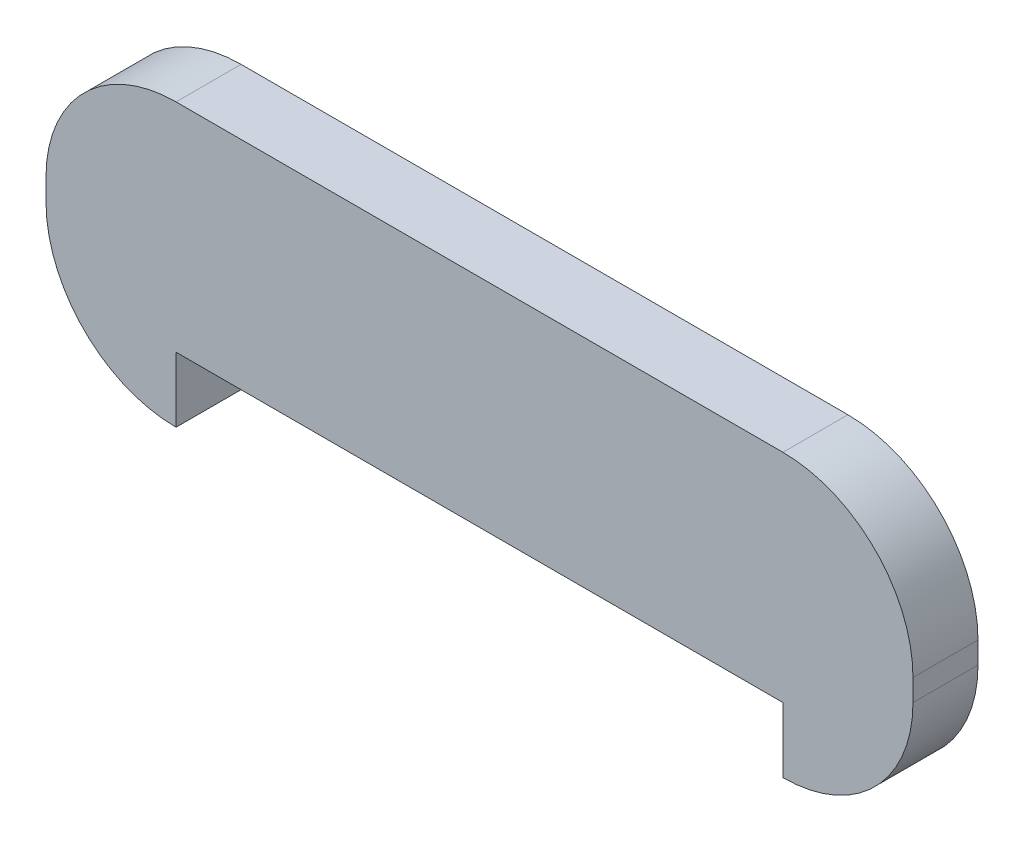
from build123d import *

# Parameters (mm, degrees)
BOSS_EXTRU_1_DEPTH = 3


with BuildPart() as part:
    # Esquisse1 → Boss.-Extru.1 (new body)
    with BuildSketch(Plane.XY):
        with BuildLine():
            Line((-48.196826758, 0), (-48.196826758, 3))
            Line((-48.196826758, 3), (-20.196826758, 3))
            Line((-20.196826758, 3), (-20.196826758, 0))
            ThreePointArc((-20.196826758, 0), (-15.954186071, 1.757359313), (-14.196826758, 6))
            Line((-14.196826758, 6), (-14.196826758, 7))
            ThreePointArc((-14.196826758, 7), (-15.954186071, 11.242640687), (-20.196826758, 13))
            Line((-20.196826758, 13), (-48.196826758, 13))
            ThreePointArc((-48.196826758, 13), (-52.439467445, 11.242640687), (-54.196826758, 7))
            Line((-54.196826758, 7), (-54.196826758, 6))
            ThreePointArc((-54.196826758, 6), (-52.439467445, 1.757359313), (-48.196826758, 0))
        make_face()
    extrude(amount=BOSS_EXTRU_1_DEPTH)


solid = part.part
